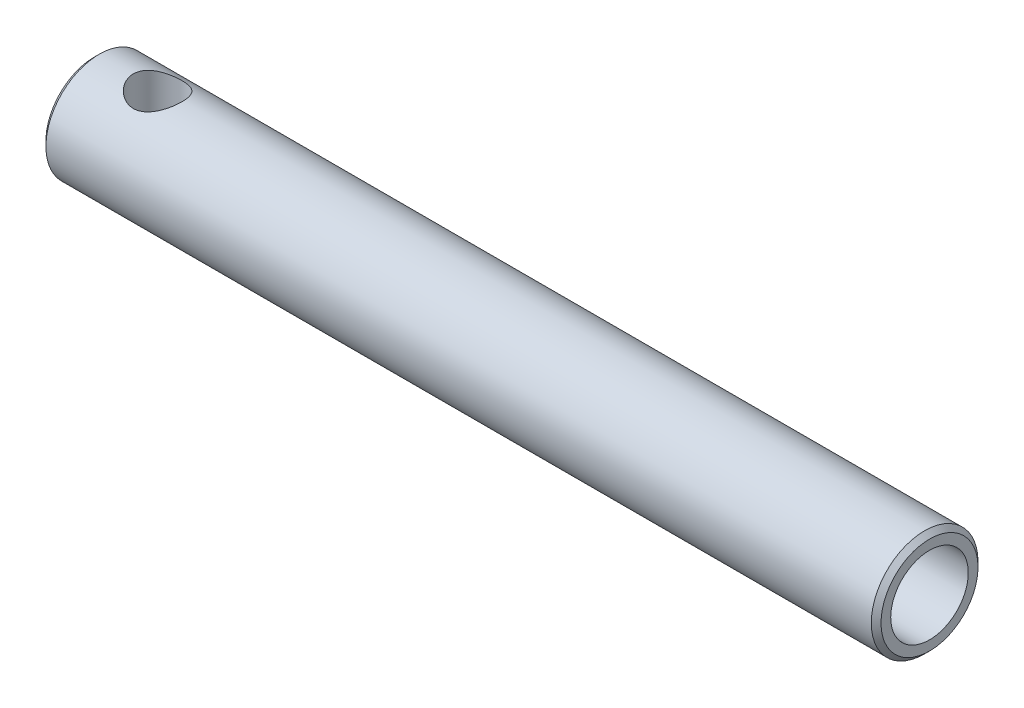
ISO-10303-21;
HEADER;
FILE_DESCRIPTION(('STEP AP214'),'2;1');
FILE_NAME('part.step','',(''),(''),'','','');
FILE_SCHEMA(('AUTOMOTIVE_DESIGN { 1 0 10303 214 1 1 1 1 }'));
ENDSEC;
DATA;
#1=APPLICATION_CONTEXT('core data for automotive mechanical design processes');
#2=APPLICATION_PROTOCOL_DEFINITION('international standard','automotive_design',2000,#1);
#3=PRODUCT_CONTEXT('',#1,'mechanical');
#4=PRODUCT('Part','Part','',(#3));
#5=PRODUCT_RELATED_PRODUCT_CATEGORY('part','',(#4));
#6=PRODUCT_DEFINITION_FORMATION('','',#4);
#7=PRODUCT_DEFINITION_CONTEXT('part definition',#1,'design');
#8=PRODUCT_DEFINITION('design','',#6,#7);
#9=PRODUCT_DEFINITION_SHAPE('','',#8);
#10=(LENGTH_UNIT() NAMED_UNIT(*) SI_UNIT(.MILLI.,.METRE.));
#11=(NAMED_UNIT(*) PLANE_ANGLE_UNIT() SI_UNIT($,.RADIAN.));
#12=(NAMED_UNIT(*) SI_UNIT($,.STERADIAN.) SOLID_ANGLE_UNIT());
#13=UNCERTAINTY_MEASURE_WITH_UNIT(LENGTH_MEASURE(1.E-05),#10,'distance_accuracy_value','');
#14=(GEOMETRIC_REPRESENTATION_CONTEXT(3) GLOBAL_UNCERTAINTY_ASSIGNED_CONTEXT((#13)) GLOBAL_UNIT_ASSIGNED_CONTEXT((#10,
#11,#12)) REPRESENTATION_CONTEXT('',''));
#15=CARTESIAN_POINT('',(0.,0.,0.));
#16=DIRECTION('',(0.,0.,1.));
#17=DIRECTION('',(1.,0.,0.));
#18=AXIS2_PLACEMENT_3D('',#15,#16,#17);
#19=CARTESIAN_POINT('',(79.585,0.,0.));
#20=DIRECTION('',(-1.,0.,0.));
#21=DIRECTION('',(0.,0.,1.));
#22=AXIS2_PLACEMENT_3D('',#19,#20,#21);
#23=PLANE('',#22);
#24=CARTESIAN_POINT('',(79.5850000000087,0.,0.));
#25=DIRECTION('',(-1.,0.,0.));
#26=DIRECTION('',(0.,0.,1.));
#27=AXIS2_PLACEMENT_3D('',#24,#25,#26);
#28=CIRCLE('',#27,4.99999999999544);
#29=CARTESIAN_POINT('',(79.5850000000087,0.,4.99999999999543));
#30=VERTEX_POINT('',#29);
#31=EDGE_CURVE('E97',#30,#30,#28,.T.);
#32=ORIENTED_EDGE('',*,*,#31,.F.);
#33=EDGE_LOOP('',(#32));
#34=FACE_BOUND('',#33,.T.);
#35=CARTESIAN_POINT('',(79.585,0.,0.));
#36=DIRECTION('',(-1.,0.,0.));
#37=DIRECTION('',(0.,0.,1.));
#38=AXIS2_PLACEMENT_3D('',#35,#36,#37);
#39=CIRCLE('',#38,4.);
#40=CARTESIAN_POINT('',(79.585,0.,3.99999999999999));
#41=VERTEX_POINT('',#40);
#42=EDGE_CURVE('E10',#41,#41,#39,.F.);
#43=ORIENTED_EDGE('',*,*,#42,.F.);
#44=EDGE_LOOP('',(#43));
#45=FACE_BOUND('',#44,.T.);
#46=ADVANCED_FACE('F15',(#34,#45),#23,.F.);
#47=CARTESIAN_POINT('',(-6.517,5.,0.));
#48=DIRECTION('',(-1.,0.,0.));
#49=DIRECTION('',(0.,0.,1.));
#50=AXIS2_PLACEMENT_3D('',#47,#48,#49);
#51=PLANE('',#50);
#52=CARTESIAN_POINT('',(-6.51699999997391,0.,0.));
#53=DIRECTION('',(1.,0.,0.));
#54=DIRECTION('',(0.,0.,-1.));
#55=AXIS2_PLACEMENT_3D('',#52,#53,#54);
#56=CIRCLE('',#55,5.00000000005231);
#57=CARTESIAN_POINT('',(-6.51699999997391,0.,-5.00000000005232));
#58=VERTEX_POINT('',#57);
#59=EDGE_CURVE('E96',#58,#58,#56,.T.);
#60=ORIENTED_EDGE('',*,*,#59,.F.);
#61=EDGE_LOOP('',(#60));
#62=FACE_BOUND('',#61,.T.);
#63=ADVANCED_FACE('F66',(#62),#51,.T.);
#64=CARTESIAN_POINT('',(-6.01699999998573,0.,0.));
#65=DIRECTION('',(1.,0.,0.));
#66=DIRECTION('',(0.,0.,-1.));
#67=AXIS2_PLACEMENT_3D('',#64,#65,#66);
#68=CONICAL_SURFACE('',#67,5.50000000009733,0.785398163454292);
#69=CARTESIAN_POINT('',(-6.017,0.,0.));
#70=DIRECTION('',(1.,0.,0.));
#71=DIRECTION('',(0.,0.,-1.));
#72=AXIS2_PLACEMENT_3D('',#69,#70,#71);
#73=CIRCLE('',#72,5.5);
#74=CARTESIAN_POINT('',(-6.017,0.,-5.50000000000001));
#75=VERTEX_POINT('',#74);
#76=EDGE_CURVE('E93',#75,#75,#73,.T.);
#77=ORIENTED_EDGE('',*,*,#76,.F.);
#78=EDGE_LOOP('',(#77));
#79=FACE_BOUND('',#78,.T.);
#80=ORIENTED_EDGE('',*,*,#59,.T.);
#81=EDGE_LOOP('',(#80));
#82=FACE_BOUND('',#81,.T.);
#83=ADVANCED_FACE('F61',(#79,#82),#68,.T.);
#84=CARTESIAN_POINT('',(0.,7.5,0.));
#85=DIRECTION('',(0.,-1.,0.));
#86=DIRECTION('',(0.,0.,-1.));
#87=AXIS2_PLACEMENT_3D('',#84,#85,#86);
#88=CYLINDRICAL_SURFACE('',#87,2.5);
#89=CARTESIAN_POINT('',(2.5,5.5,0.));
#90=CARTESIAN_POINT('',(2.49999250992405,5.49999367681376,0.132952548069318));
#91=CARTESIAN_POINT('',(2.48934103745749,5.49512976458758,0.266000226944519));
#92=CARTESIAN_POINT('',(2.44718796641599,5.4761654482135,0.528154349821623));
#93=CARTESIAN_POINT('',(2.41566105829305,5.46205383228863,0.65725581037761));
#94=CARTESIAN_POINT('',(2.33320007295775,5.4260902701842,0.907454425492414));
#95=CARTESIAN_POINT('',(2.28232824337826,5.40426316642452,1.02857580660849));
#96=CARTESIAN_POINT('',(2.16292887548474,5.35493340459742,1.26046092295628));
#97=CARTESIAN_POINT('',(2.09440017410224,5.32743037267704,1.3712239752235));
#98=CARTESIAN_POINT('',(1.93751175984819,5.26767700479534,1.58575631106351));
#99=CARTESIAN_POINT('',(1.84830020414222,5.23525329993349,1.68885372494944));
#100=CARTESIAN_POINT('',(1.65439509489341,5.16997972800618,1.87921657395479));
#101=CARTESIAN_POINT('',(1.54969283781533,5.1371296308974,1.96647304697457));
#102=CARTESIAN_POINT('',(1.32005556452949,5.07244506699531,2.12798810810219));
#103=CARTESIAN_POINT('',(1.194275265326,5.0407952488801,2.20112697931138));
#104=CARTESIAN_POINT('',(0.930569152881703,4.98491987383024,2.32491281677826));
#105=CARTESIAN_POINT('',(0.792650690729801,4.96068986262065,2.37557328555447));
#106=CARTESIAN_POINT('',(0.51630463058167,4.92431405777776,2.45005624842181));
#107=CARTESIAN_POINT('',(0.37830865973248,4.91158516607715,2.47518298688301));
#108=CARTESIAN_POINT('',(0.099518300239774,4.89801821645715,2.50193278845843));
#109=CARTESIAN_POINT('',(-0.0412740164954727,4.89717166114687,2.50357264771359));
#110=CARTESIAN_POINT('',(-0.307410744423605,4.90698153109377,2.48427141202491));
#111=CARTESIAN_POINT('',(-0.432957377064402,4.91655818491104,2.46545016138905));
#112=CARTESIAN_POINT('',(-0.678866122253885,4.94428110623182,2.40936763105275));
#113=CARTESIAN_POINT('',(-0.799226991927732,4.96242941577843,2.37210195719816));
#114=CARTESIAN_POINT('',(-1.03463835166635,5.00567240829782,2.27945117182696));
#115=CARTESIAN_POINT('',(-1.14950540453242,5.0309159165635,2.22367262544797));
#116=CARTESIAN_POINT('',(-1.36874458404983,5.08548576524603,2.09586635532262));
#117=CARTESIAN_POINT('',(-1.47311249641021,5.11481373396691,2.02383214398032));
#118=CARTESIAN_POINT('',(-1.67963392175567,5.17788836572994,1.85693531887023));
#119=CARTESIAN_POINT('',(-1.78046909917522,5.21178016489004,1.76049136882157));
#120=CARTESIAN_POINT('',(-1.96504884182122,5.27768620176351,1.55177301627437));
#121=CARTESIAN_POINT('',(-2.048783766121,5.30969937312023,1.43948974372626));
#122=CARTESIAN_POINT('',(-2.19925634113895,5.36952529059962,1.19758743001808));
#123=CARTESIAN_POINT('',(-2.26534746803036,5.39716612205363,1.06752105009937));
#124=CARTESIAN_POINT('',(-2.37414662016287,5.44372431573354,0.796639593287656));
#125=CARTESIAN_POINT('',(-2.41690044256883,5.46265875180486,0.655846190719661));
#126=CARTESIAN_POINT('',(-2.46457052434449,5.48396621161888,0.428102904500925));
#127=CARTESIAN_POINT('',(-2.47782952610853,5.48995246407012,0.343150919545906));
#128=CARTESIAN_POINT('',(-2.49554651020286,5.49797132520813,0.172145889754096));
#129=CARTESIAN_POINT('',(-2.50000485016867,5.50000409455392,0.0860928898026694));
#130=CARTESIAN_POINT('',(-2.49999250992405,5.49999367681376,-0.132952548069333));
#131=CARTESIAN_POINT('',(-2.48934103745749,5.49512976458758,-0.266000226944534));
#132=CARTESIAN_POINT('',(-2.44718796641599,5.4761654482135,-0.528154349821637));
#133=CARTESIAN_POINT('',(-2.41566105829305,5.46205383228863,-0.657255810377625));
#134=CARTESIAN_POINT('',(-2.33320007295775,5.4260902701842,-0.907454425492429));
#135=CARTESIAN_POINT('',(-2.28232824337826,5.40426316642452,-1.0285758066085));
#136=CARTESIAN_POINT('',(-2.16292887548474,5.35493340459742,-1.2604609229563));
#137=CARTESIAN_POINT('',(-2.09440017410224,5.32743037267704,-1.37122397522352));
#138=CARTESIAN_POINT('',(-1.93751175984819,5.26767700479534,-1.58575631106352));
#139=CARTESIAN_POINT('',(-1.84830020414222,5.23525329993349,-1.68885372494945));
#140=CARTESIAN_POINT('',(-1.65439509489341,5.16997972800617,-1.8792165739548));
#141=CARTESIAN_POINT('',(-1.54969283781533,5.1371296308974,-1.96647304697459));
#142=CARTESIAN_POINT('',(-1.32005556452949,5.07244506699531,-2.1279881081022));
#143=CARTESIAN_POINT('',(-1.194275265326,5.0407952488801,-2.20112697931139));
#144=CARTESIAN_POINT('',(-0.930569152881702,4.98491987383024,-2.32491281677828));
#145=CARTESIAN_POINT('',(-0.7926506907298,4.96068986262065,-2.37557328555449));
#146=CARTESIAN_POINT('',(-0.516304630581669,4.92431405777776,-2.45005624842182));
#147=CARTESIAN_POINT('',(-0.378308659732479,4.91158516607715,-2.47518298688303));
#148=CARTESIAN_POINT('',(-0.0995183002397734,4.89801821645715,-2.50193278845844));
#149=CARTESIAN_POINT('',(0.0412740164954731,4.89717166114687,-2.5035726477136));
#150=CARTESIAN_POINT('',(0.307410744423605,4.90698153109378,-2.48427141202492));
#151=CARTESIAN_POINT('',(0.432957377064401,4.91655818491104,-2.46545016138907));
#152=CARTESIAN_POINT('',(0.678866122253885,4.94428110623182,-2.40936763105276));
#153=CARTESIAN_POINT('',(0.799226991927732,4.96242941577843,-2.37210195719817));
#154=CARTESIAN_POINT('',(1.03463835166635,5.00567240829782,-2.27945117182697));
#155=CARTESIAN_POINT('',(1.14950540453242,5.0309159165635,-2.22367262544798));
#156=CARTESIAN_POINT('',(1.36874458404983,5.08548576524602,-2.09586635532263));
#157=CARTESIAN_POINT('',(1.47311249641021,5.11481373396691,-2.02383214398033));
#158=CARTESIAN_POINT('',(1.67963392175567,5.17788836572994,-1.85693531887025));
#159=CARTESIAN_POINT('',(1.78046909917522,5.21178016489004,-1.76049136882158));
#160=CARTESIAN_POINT('',(1.96504884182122,5.27768620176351,-1.55177301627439));
#161=CARTESIAN_POINT('',(2.048783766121,5.30969937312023,-1.43948974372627));
#162=CARTESIAN_POINT('',(2.19925634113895,5.36952529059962,-1.1975874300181));
#163=CARTESIAN_POINT('',(2.26534746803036,5.39716612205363,-1.06752105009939));
#164=CARTESIAN_POINT('',(2.37414662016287,5.44372431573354,-0.796639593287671));
#165=CARTESIAN_POINT('',(2.41690044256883,5.46265875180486,-0.655846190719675));
#166=CARTESIAN_POINT('',(2.46457052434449,5.48396621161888,-0.428102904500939));
#167=CARTESIAN_POINT('',(2.47782952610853,5.48995246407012,-0.34315091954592));
#168=CARTESIAN_POINT('',(2.49554651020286,5.49797132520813,-0.17214588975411));
#169=CARTESIAN_POINT('',(2.50000485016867,5.50000409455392,-0.0860928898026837));
#170=CARTESIAN_POINT('',(2.5,5.5,0.));
#171=B_SPLINE_CURVE_WITH_KNOTS('',3,(#89,#90,#91,#92,#93,#94,#95,#96,#97,#98,#99,#100,#101,#102,
#103,#104,#105,#106,#107,#108,#109,#110,#111,#112,#113,#114,#115,#116,#117,#118,#119,#120,#121,
#122,#123,#124,#125,#126,#127,#128,#129,#130,#131,#132,#133,#134,#135,#136,#137,#138,#139,#140,
#141,#142,#143,#144,#145,#146,#147,#148,#149,#150,#151,#152,#153,#154,#155,#156,#157,#158,#159,
#160,#161,#162,#163,#164,#165,#166,#167,#168,#169,#170),.UNSPECIFIED.,.T.,.F.,(4,2,2,2,2,2,2,2,
2,2,2,2,2,2,2,2,2,2,2,2,2,2,2,2,2,2,2,2,2,2,2,2,2,2,2,2,2,2,2,2,4),(0.,0.398521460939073,
0.797526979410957,1.19525930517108,1.59301783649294,2.01164600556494,2.43051028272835,
2.87496361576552,3.31914960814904,3.73929300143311,4.15913592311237,4.5392925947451,
4.91953987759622,5.30844947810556,5.69751456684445,6.12637378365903,6.55547412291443,
6.99862849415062,7.44091006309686,7.69898152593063,7.95704250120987,8.35556396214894,
8.75456948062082,9.15230180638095,9.55006033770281,9.96868850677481,10.3875527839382,
10.8320061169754,11.2761921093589,11.696335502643,12.1161784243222,12.496335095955,
12.8765823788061,13.2654919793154,13.6545570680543,14.0834162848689,14.5125166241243,
14.9556709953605,15.3979525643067,15.6560240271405,15.9140850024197),.UNSPECIFIED.);
#172=CARTESIAN_POINT('',(2.5,5.5,0.));
#173=VERTEX_POINT('',#172);
#174=EDGE_CURVE('E21',#173,#173,#171,.T.);
#175=ORIENTED_EDGE('',*,*,#174,.F.);
#176=EDGE_LOOP('',(#175));
#177=FACE_BOUND('',#176,.T.);
#178=CARTESIAN_POINT('',(-2.5,-5.5,0.));
#179=CARTESIAN_POINT('',(-2.49999250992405,-5.49999367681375,0.132952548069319));
#180=CARTESIAN_POINT('',(-2.48934103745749,-5.49512976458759,0.266000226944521));
#181=CARTESIAN_POINT('',(-2.44718796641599,-5.47616544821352,0.528154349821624));
#182=CARTESIAN_POINT('',(-2.41566105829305,-5.46205383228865,0.657255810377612));
#183=CARTESIAN_POINT('',(-2.33320007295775,-5.42609027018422,0.907454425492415));
#184=CARTESIAN_POINT('',(-2.28232824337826,-5.40426316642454,1.02857580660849));
#185=CARTESIAN_POINT('',(-2.16292887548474,-5.35493340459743,1.26046092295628));
#186=CARTESIAN_POINT('',(-2.09440017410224,-5.32743037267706,1.37122397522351));
#187=CARTESIAN_POINT('',(-1.93751175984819,-5.26767700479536,1.58575631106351));
#188=CARTESIAN_POINT('',(-1.84830020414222,-5.23525329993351,1.68885372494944));
#189=CARTESIAN_POINT('',(-1.65439509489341,-5.16997972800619,1.87921657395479));
#190=CARTESIAN_POINT('',(-1.54969283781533,-5.13712963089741,1.96647304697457));
#191=CARTESIAN_POINT('',(-1.32005556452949,-5.07244506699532,2.12798810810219));
#192=CARTESIAN_POINT('',(-1.194275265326,-5.04079524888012,2.20112697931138));
#193=CARTESIAN_POINT('',(-0.930569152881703,-4.98491987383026,2.32491281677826));
#194=CARTESIAN_POINT('',(-0.7926506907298,-4.96068986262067,2.37557328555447));
#195=CARTESIAN_POINT('',(-0.516304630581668,-4.92431405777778,2.45005624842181));
#196=CARTESIAN_POINT('',(-0.378308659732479,-4.91158516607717,2.47518298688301));
#197=CARTESIAN_POINT('',(-0.099518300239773,-4.89801821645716,2.50193278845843));
#198=CARTESIAN_POINT('',(0.0412740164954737,-4.89717166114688,2.50357264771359));
#199=CARTESIAN_POINT('',(0.307410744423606,-4.90698153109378,2.48427141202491));
#200=CARTESIAN_POINT('',(0.432957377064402,-4.91655818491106,2.46545016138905));
#201=CARTESIAN_POINT('',(0.678866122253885,-4.94428110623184,2.40936763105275));
#202=CARTESIAN_POINT('',(0.799226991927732,-4.96242941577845,2.37210195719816));
#203=CARTESIAN_POINT('',(1.03463835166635,-5.00567240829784,2.27945117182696));
#204=CARTESIAN_POINT('',(1.14950540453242,-5.03091591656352,2.22367262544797));
#205=CARTESIAN_POINT('',(1.36874458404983,-5.08548576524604,2.09586635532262));
#206=CARTESIAN_POINT('',(1.47311249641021,-5.11481373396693,2.02383214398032));
#207=CARTESIAN_POINT('',(1.67963392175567,-5.17788836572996,1.85693531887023));
#208=CARTESIAN_POINT('',(1.78046909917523,-5.21178016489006,1.76049136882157));
#209=CARTESIAN_POINT('',(1.96504884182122,-5.27768620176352,1.55177301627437));
#210=CARTESIAN_POINT('',(2.048783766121,-5.30969937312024,1.43948974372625));
#211=CARTESIAN_POINT('',(2.19925634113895,-5.36952529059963,1.19758743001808));
#212=CARTESIAN_POINT('',(2.26534746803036,-5.39716612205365,1.06752105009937));
#213=CARTESIAN_POINT('',(2.37414662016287,-5.44372431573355,0.796639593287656));
#214=CARTESIAN_POINT('',(2.41690044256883,-5.46265875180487,0.655846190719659));
#215=CARTESIAN_POINT('',(2.46457052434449,-5.48396621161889,0.428102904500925));
#216=CARTESIAN_POINT('',(2.47782952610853,-5.48995246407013,0.343150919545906));
#217=CARTESIAN_POINT('',(2.49554651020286,-5.49797132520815,0.172145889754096));
#218=CARTESIAN_POINT('',(2.50000485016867,-5.50000409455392,0.0860928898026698));
#219=CARTESIAN_POINT('',(2.49999250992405,-5.49999367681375,-0.132952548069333));
#220=CARTESIAN_POINT('',(2.48934103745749,-5.49512976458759,-0.266000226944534));
#221=CARTESIAN_POINT('',(2.44718796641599,-5.47616544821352,-0.528154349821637));
#222=CARTESIAN_POINT('',(2.41566105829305,-5.46205383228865,-0.657255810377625));
#223=CARTESIAN_POINT('',(2.33320007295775,-5.42609027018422,-0.907454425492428));
#224=CARTESIAN_POINT('',(2.28232824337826,-5.40426316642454,-1.0285758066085));
#225=CARTESIAN_POINT('',(2.16292887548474,-5.35493340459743,-1.26046092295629));
#226=CARTESIAN_POINT('',(2.09440017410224,-5.32743037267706,-1.37122397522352));
#227=CARTESIAN_POINT('',(1.93751175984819,-5.26767700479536,-1.58575631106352));
#228=CARTESIAN_POINT('',(1.84830020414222,-5.23525329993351,-1.68885372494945));
#229=CARTESIAN_POINT('',(1.65439509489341,-5.16997972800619,-1.8792165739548));
#230=CARTESIAN_POINT('',(1.54969283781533,-5.13712963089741,-1.96647304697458));
#231=CARTESIAN_POINT('',(1.32005556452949,-5.07244506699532,-2.1279881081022));
#232=CARTESIAN_POINT('',(1.194275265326,-5.04079524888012,-2.20112697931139));
#233=CARTESIAN_POINT('',(0.930569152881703,-4.98491987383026,-2.32491281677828));
#234=CARTESIAN_POINT('',(0.7926506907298,-4.96068986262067,-2.37557328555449));
#235=CARTESIAN_POINT('',(0.516304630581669,-4.92431405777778,-2.45005624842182));
#236=CARTESIAN_POINT('',(0.378308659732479,-4.91158516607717,-2.47518298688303));
#237=CARTESIAN_POINT('',(0.0995183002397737,-4.89801821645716,-2.50193278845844));
#238=CARTESIAN_POINT('',(-0.0412740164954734,-4.89717166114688,-2.5035726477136));
#239=CARTESIAN_POINT('',(-0.307410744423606,-4.90698153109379,-2.48427141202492));
#240=CARTESIAN_POINT('',(-0.432957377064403,-4.91655818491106,-2.46545016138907));
#241=CARTESIAN_POINT('',(-0.678866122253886,-4.94428110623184,-2.40936763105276));
#242=CARTESIAN_POINT('',(-0.799226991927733,-4.96242941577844,-2.37210195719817));
#243=CARTESIAN_POINT('',(-1.03463835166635,-5.00567240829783,-2.27945117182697));
#244=CARTESIAN_POINT('',(-1.14950540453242,-5.03091591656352,-2.22367262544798));
#245=CARTESIAN_POINT('',(-1.36874458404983,-5.08548576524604,-2.09586635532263));
#246=CARTESIAN_POINT('',(-1.47311249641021,-5.11481373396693,-2.02383214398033));
#247=CARTESIAN_POINT('',(-1.67963392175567,-5.17788836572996,-1.85693531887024));
#248=CARTESIAN_POINT('',(-1.78046909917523,-5.21178016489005,-1.76049136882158));
#249=CARTESIAN_POINT('',(-1.96504884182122,-5.27768620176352,-1.55177301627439));
#250=CARTESIAN_POINT('',(-2.048783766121,-5.30969937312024,-1.43948974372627));
#251=CARTESIAN_POINT('',(-2.19925634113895,-5.36952529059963,-1.19758743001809));
#252=CARTESIAN_POINT('',(-2.26534746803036,-5.39716612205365,-1.06752105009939));
#253=CARTESIAN_POINT('',(-2.37414662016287,-5.44372431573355,-0.796639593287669));
#254=CARTESIAN_POINT('',(-2.41690044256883,-5.46265875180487,-0.655846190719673));
#255=CARTESIAN_POINT('',(-2.46457052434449,-5.48396621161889,-0.428102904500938));
#256=CARTESIAN_POINT('',(-2.47782952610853,-5.48995246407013,-0.34315091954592));
#257=CARTESIAN_POINT('',(-2.49554651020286,-5.49797132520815,-0.17214588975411));
#258=CARTESIAN_POINT('',(-2.50000485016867,-5.50000409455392,-0.0860928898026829));
#259=CARTESIAN_POINT('',(-2.5,-5.5,0.));
#260=B_SPLINE_CURVE_WITH_KNOTS('',3,(#178,#179,#180,#181,#182,#183,#184,#185,#186,#187,#188,
#189,#190,#191,#192,#193,#194,#195,#196,#197,#198,#199,#200,#201,#202,#203,#204,#205,#206,#207,
#208,#209,#210,#211,#212,#213,#214,#215,#216,#217,#218,#219,#220,#221,#222,#223,#224,#225,#226,
#227,#228,#229,#230,#231,#232,#233,#234,#235,#236,#237,#238,#239,#240,#241,#242,#243,#244,#245,
#246,#247,#248,#249,#250,#251,#252,#253,#254,#255,#256,#257,#258,#259),.UNSPECIFIED.,.T.,.F.,(4,
2,2,2,2,2,2,2,2,2,2,2,2,2,2,2,2,2,2,2,2,2,2,2,2,2,2,2,2,2,2,2,2,2,2,2,2,2,2,2,4),(0.,
0.398521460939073,0.797526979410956,1.19525930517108,1.59301783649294,2.01164600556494,
2.43051028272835,2.87496361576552,3.31914960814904,3.73929300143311,4.15913592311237,
4.5392925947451,4.91953987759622,5.30844947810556,5.69751456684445,6.12637378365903,
6.55547412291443,6.99862849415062,7.44091006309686,7.69898152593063,7.95704250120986,
8.35556396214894,8.75456948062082,9.15230180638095,9.55006033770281,9.9686885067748,
10.3875527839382,10.8320061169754,11.2761921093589,11.696335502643,12.1161784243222,
12.496335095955,12.8765823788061,13.2654919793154,13.6545570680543,14.0834162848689,
14.5125166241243,14.9556709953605,15.3979525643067,15.6560240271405,15.9140850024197),.UNSPECIFIED.);
#261=CARTESIAN_POINT('',(-2.5,-5.5,0.));
#262=VERTEX_POINT('',#261);
#263=EDGE_CURVE('E30',#262,#262,#260,.T.);
#264=ORIENTED_EDGE('',*,*,#263,.F.);
#265=EDGE_LOOP('',(#264));
#266=FACE_BOUND('',#265,.T.);
#267=ADVANCED_FACE('F43',(#177,#266),#88,.F.);
#268=CARTESIAN_POINT('',(-6.517,0.,0.));
#269=DIRECTION('',(1.,0.,0.));
#270=DIRECTION('',(0.,0.,-1.));
#271=AXIS2_PLACEMENT_3D('',#268,#269,#270);
#272=CYLINDRICAL_SURFACE('',#271,5.5);
#273=ORIENTED_EDGE('',*,*,#263,.T.);
#274=EDGE_LOOP('',(#273));
#275=FACE_BOUND('',#274,.T.);
#276=CARTESIAN_POINT('',(79.085,0.,0.));
#277=DIRECTION('',(1.,0.,0.));
#278=DIRECTION('',(0.,0.,-1.));
#279=AXIS2_PLACEMENT_3D('',#276,#277,#278);
#280=CIRCLE('',#279,5.5);
#281=CARTESIAN_POINT('',(79.085,0.,-5.50000000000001));
#282=VERTEX_POINT('',#281);
#283=EDGE_CURVE('E25',#282,#282,#280,.F.);
#284=ORIENTED_EDGE('',*,*,#283,.T.);
#285=EDGE_LOOP('',(#284));
#286=FACE_BOUND('',#285,.T.);
#287=ORIENTED_EDGE('',*,*,#174,.T.);
#288=EDGE_LOOP('',(#287));
#289=FACE_BOUND('',#288,.T.);
#290=ORIENTED_EDGE('',*,*,#76,.T.);
#291=EDGE_LOOP('',(#290));
#292=FACE_BOUND('',#291,.T.);
#293=ADVANCED_FACE('F46',(#275,#286,#289,#292),#272,.T.);
#294=CARTESIAN_POINT('',(79.0850000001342,0.,0.));
#295=DIRECTION('',(-1.,0.,0.));
#296=DIRECTION('',(0.,0.,1.));
#297=AXIS2_PLACEMENT_3D('',#294,#295,#296);
#298=CONICAL_SURFACE('',#297,5.49999999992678,0.785398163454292);
#299=ORIENTED_EDGE('',*,*,#283,.F.);
#300=EDGE_LOOP('',(#299));
#301=FACE_BOUND('',#300,.T.);
#302=ORIENTED_EDGE('',*,*,#31,.T.);
#303=EDGE_LOOP('',(#302));
#304=FACE_BOUND('',#303,.T.);
#305=ADVANCED_FACE('F49',(#301,#304),#298,.T.);
#306=CARTESIAN_POINT('',(54.585,3.4,0.));
#307=DIRECTION('',(-1.,0.,0.));
#308=DIRECTION('',(0.,0.,1.));
#309=AXIS2_PLACEMENT_3D('',#306,#307,#308);
#310=PLANE('',#309);
#311=CARTESIAN_POINT('',(54.585,0.,0.));
#312=DIRECTION('',(-1.,0.,0.));
#313=DIRECTION('',(0.,0.,1.));
#314=AXIS2_PLACEMENT_3D('',#311,#312,#313);
#315=CIRCLE('',#314,4.);
#316=CARTESIAN_POINT('',(54.585,0.,3.99999999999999));
#317=VERTEX_POINT('',#316);
#318=EDGE_CURVE('E98',#317,#317,#315,.F.);
#319=ORIENTED_EDGE('',*,*,#318,.T.);
#320=EDGE_LOOP('',(#319));
#321=FACE_BOUND('',#320,.T.);
#322=ADVANCED_FACE('F58',(#321),#310,.F.);
#323=CARTESIAN_POINT('',(91.585,0.,0.));
#324=DIRECTION('',(-1.,0.,0.));
#325=DIRECTION('',(0.,0.,1.));
#326=AXIS2_PLACEMENT_3D('',#323,#324,#325);
#327=CYLINDRICAL_SURFACE('',#326,4.);
#328=ORIENTED_EDGE('',*,*,#42,.T.);
#329=EDGE_LOOP('',(#328));
#330=FACE_BOUND('',#329,.T.);
#331=ORIENTED_EDGE('',*,*,#318,.F.);
#332=EDGE_LOOP('',(#331));
#333=FACE_BOUND('',#332,.T.);
#334=ADVANCED_FACE('F60',(#330,#333),#327,.F.);
#335=CLOSED_SHELL('',(#46,#63,#83,#267,#293,#305,#322,#334));
#336=MANIFOLD_SOLID_BREP('B1',#335);
#337=ADVANCED_BREP_SHAPE_REPRESENTATION('',(#18,#336),#14);
#338=SHAPE_DEFINITION_REPRESENTATION(#9,#337);
ENDSEC;
END-ISO-10303-21;
